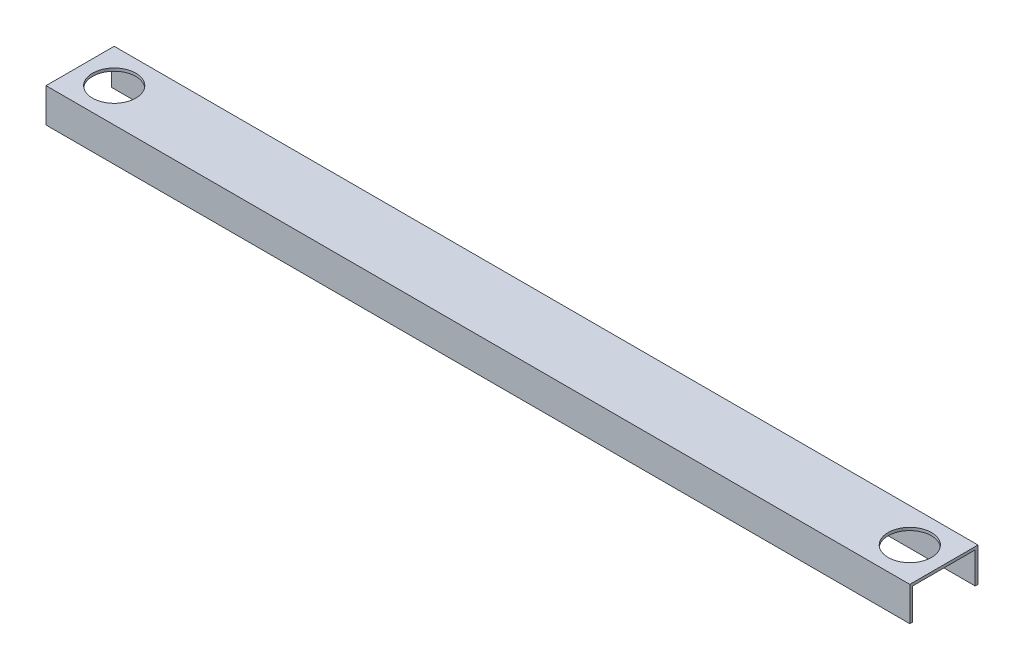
ISO-10303-21;
HEADER;
FILE_DESCRIPTION(('STEP AP214'),'2;1');
FILE_NAME('part.step','',(''),(''),'','','');
FILE_SCHEMA(('AUTOMOTIVE_DESIGN { 1 0 10303 214 1 1 1 1 }'));
ENDSEC;
DATA;
#1=APPLICATION_CONTEXT('core data for automotive mechanical design processes');
#2=APPLICATION_PROTOCOL_DEFINITION('international standard','automotive_design',2000,#1);
#3=PRODUCT_CONTEXT('',#1,'mechanical');
#4=PRODUCT('Part','Part','',(#3));
#5=PRODUCT_RELATED_PRODUCT_CATEGORY('part','',(#4));
#6=PRODUCT_DEFINITION_FORMATION('','',#4);
#7=PRODUCT_DEFINITION_CONTEXT('part definition',#1,'design');
#8=PRODUCT_DEFINITION('design','',#6,#7);
#9=PRODUCT_DEFINITION_SHAPE('','',#8);
#10=(LENGTH_UNIT() NAMED_UNIT(*) SI_UNIT(.MILLI.,.METRE.));
#11=(NAMED_UNIT(*) PLANE_ANGLE_UNIT() SI_UNIT($,.RADIAN.));
#12=(NAMED_UNIT(*) SI_UNIT($,.STERADIAN.) SOLID_ANGLE_UNIT());
#13=UNCERTAINTY_MEASURE_WITH_UNIT(LENGTH_MEASURE(1.E-05),#10,'distance_accuracy_value','');
#14=(GEOMETRIC_REPRESENTATION_CONTEXT(3) GLOBAL_UNCERTAINTY_ASSIGNED_CONTEXT((#13)) GLOBAL_UNIT_ASSIGNED_CONTEXT((#10,
#11,#12)) REPRESENTATION_CONTEXT('',''));
#15=CARTESIAN_POINT('',(0.,0.,0.));
#16=DIRECTION('',(0.,0.,1.));
#17=DIRECTION('',(1.,0.,0.));
#18=AXIS2_PLACEMENT_3D('',#15,#16,#17);
#19=CARTESIAN_POINT('',(482.6,19.05,38.1));
#20=DIRECTION('',(0.,-1.,0.));
#21=DIRECTION('',(0.,0.,-1.));
#22=AXIS2_PLACEMENT_3D('',#19,#20,#21);
#23=PLANE('',#22);
#24=DIRECTION('',(0.,0.,1.));
#25=VECTOR('',#24,1.);
#26=CARTESIAN_POINT('',(-482.6,19.05,38.1));
#27=LINE('',#26,#25);
#28=CARTESIAN_POINT('',(-482.6,19.05,-38.1));
#29=VERTEX_POINT('',#28);
#30=CARTESIAN_POINT('',(-482.6,19.05,38.1));
#31=VERTEX_POINT('',#30);
#32=EDGE_CURVE('E133',#29,#31,#27,.T.);
#33=ORIENTED_EDGE('',*,*,#32,.T.);
#34=DIRECTION('',(-1.,0.,0.));
#35=VECTOR('',#34,1.);
#36=CARTESIAN_POINT('',(482.6,19.05,38.1));
#37=LINE('',#36,#35);
#38=CARTESIAN_POINT('',(482.6,19.05,38.1));
#39=VERTEX_POINT('',#38);
#40=EDGE_CURVE('E40',#39,#31,#37,.T.);
#41=ORIENTED_EDGE('',*,*,#40,.F.);
#42=DIRECTION('',(0.,0.,1.));
#43=VECTOR('',#42,1.);
#44=CARTESIAN_POINT('',(482.6,19.05,38.1));
#45=LINE('',#44,#43);
#46=CARTESIAN_POINT('',(482.6,19.05,-38.1));
#47=VERTEX_POINT('',#46);
#48=EDGE_CURVE('E91',#47,#39,#45,.T.);
#49=ORIENTED_EDGE('',*,*,#48,.F.);
#50=DIRECTION('',(-1.,0.,0.));
#51=VECTOR('',#50,1.);
#52=CARTESIAN_POINT('',(482.6,19.05,-38.1));
#53=LINE('',#52,#51);
#54=EDGE_CURVE('E11',#47,#29,#53,.T.);
#55=ORIENTED_EDGE('',*,*,#54,.T.);
#56=EDGE_LOOP('',(#33,#41,#49,#55));
#57=FACE_BOUND('',#56,.T.);
#58=CARTESIAN_POINT('',(-444.5,19.05,0.));
#59=DIRECTION('',(0.,1.,0.));
#60=DIRECTION('',(0.,0.,1.));
#61=AXIS2_PLACEMENT_3D('',#58,#59,#60);
#62=CIRCLE('',#61,24.1935);
#63=CARTESIAN_POINT('',(-444.5,19.05,24.1935));
#64=VERTEX_POINT('',#63);
#65=EDGE_CURVE('E158',#64,#64,#62,.T.);
#66=ORIENTED_EDGE('',*,*,#65,.F.);
#67=EDGE_LOOP('',(#66));
#68=FACE_BOUND('',#67,.T.);
#69=CARTESIAN_POINT('',(444.5,19.05,0.));
#70=DIRECTION('',(0.,-1.,0.));
#71=DIRECTION('',(0.,0.,1.));
#72=AXIS2_PLACEMENT_3D('',#69,#70,#71);
#73=CIRCLE('',#72,24.1935);
#74=CARTESIAN_POINT('',(444.5,19.05,24.1935));
#75=VERTEX_POINT('',#74);
#76=EDGE_CURVE('E165',#75,#75,#73,.T.);
#77=ORIENTED_EDGE('',*,*,#76,.T.);
#78=EDGE_LOOP('',(#77));
#79=FACE_BOUND('',#78,.T.);
#80=ADVANCED_FACE('F30',(#57,#68,#79),#23,.F.);
#81=CARTESIAN_POINT('',(482.6,15.875,34.925));
#82=DIRECTION('',(0.,1.,0.));
#83=DIRECTION('',(0.,0.,1.));
#84=AXIS2_PLACEMENT_3D('',#81,#82,#83);
#85=PLANE('',#84);
#86=DIRECTION('',(0.,0.,-1.));
#87=VECTOR('',#86,1.);
#88=CARTESIAN_POINT('',(-482.6,15.875,34.925));
#89=LINE('',#88,#87);
#90=CARTESIAN_POINT('',(-482.6,15.875,34.925));
#91=VERTEX_POINT('',#90);
#92=CARTESIAN_POINT('',(-482.6,15.875,-34.925));
#93=VERTEX_POINT('',#92);
#94=EDGE_CURVE('E120',#91,#93,#89,.T.);
#95=ORIENTED_EDGE('',*,*,#94,.T.);
#96=DIRECTION('',(-1.,0.,0.));
#97=VECTOR('',#96,1.);
#98=CARTESIAN_POINT('',(482.6,15.875,-34.925));
#99=LINE('',#98,#97);
#100=CARTESIAN_POINT('',(482.6,15.875,-34.925));
#101=VERTEX_POINT('',#100);
#102=EDGE_CURVE('E116',#101,#93,#99,.T.);
#103=ORIENTED_EDGE('',*,*,#102,.F.);
#104=DIRECTION('',(0.,0.,-1.));
#105=VECTOR('',#104,1.);
#106=CARTESIAN_POINT('',(482.6,15.875,34.925));
#107=LINE('',#106,#105);
#108=CARTESIAN_POINT('',(482.6,15.875,34.925));
#109=VERTEX_POINT('',#108);
#110=EDGE_CURVE('E104',#109,#101,#107,.T.);
#111=ORIENTED_EDGE('',*,*,#110,.F.);
#112=DIRECTION('',(-1.,0.,0.));
#113=VECTOR('',#112,1.);
#114=CARTESIAN_POINT('',(482.6,15.875,34.925));
#115=LINE('',#114,#113);
#116=EDGE_CURVE('E121',#109,#91,#115,.T.);
#117=ORIENTED_EDGE('',*,*,#116,.T.);
#118=EDGE_LOOP('',(#95,#103,#111,#117));
#119=FACE_BOUND('',#118,.T.);
#120=CARTESIAN_POINT('',(-444.5,15.875,0.));
#121=DIRECTION('',(0.,1.,0.));
#122=DIRECTION('',(0.,0.,1.));
#123=AXIS2_PLACEMENT_3D('',#120,#121,#122);
#124=CIRCLE('',#123,24.1935);
#125=CARTESIAN_POINT('',(-444.5,15.875,24.1935));
#126=VERTEX_POINT('',#125);
#127=EDGE_CURVE('E134',#126,#126,#124,.T.);
#128=ORIENTED_EDGE('',*,*,#127,.T.);
#129=EDGE_LOOP('',(#128));
#130=FACE_BOUND('',#129,.T.);
#131=CARTESIAN_POINT('',(444.5,15.875,0.));
#132=DIRECTION('',(0.,1.,0.));
#133=DIRECTION('',(0.,0.,1.));
#134=AXIS2_PLACEMENT_3D('',#131,#132,#133);
#135=CIRCLE('',#134,24.1935);
#136=CARTESIAN_POINT('',(444.5,15.875,24.1935));
#137=VERTEX_POINT('',#136);
#138=EDGE_CURVE('E34',#137,#137,#135,.F.);
#139=ORIENTED_EDGE('',*,*,#138,.F.);
#140=EDGE_LOOP('',(#139));
#141=FACE_BOUND('',#140,.T.);
#142=ADVANCED_FACE('F117',(#119,#130,#141),#85,.F.);
#143=CARTESIAN_POINT('',(482.6,-19.05,-38.1));
#144=DIRECTION('',(0.,0.,1.));
#145=DIRECTION('',(1.,0.,0.));
#146=AXIS2_PLACEMENT_3D('',#143,#144,#145);
#147=PLANE('',#146);
#148=DIRECTION('',(0.,1.,0.));
#149=VECTOR('',#148,1.);
#150=CARTESIAN_POINT('',(-482.6,-19.05,-38.1));
#151=LINE('',#150,#149);
#152=CARTESIAN_POINT('',(-482.6,-19.05,-38.1));
#153=VERTEX_POINT('',#152);
#154=EDGE_CURVE('E130',#153,#29,#151,.T.);
#155=ORIENTED_EDGE('',*,*,#154,.T.);
#156=ORIENTED_EDGE('',*,*,#54,.F.);
#157=DIRECTION('',(0.,1.,0.));
#158=VECTOR('',#157,1.);
#159=CARTESIAN_POINT('',(482.6,-19.05,-38.1));
#160=LINE('',#159,#158);
#161=CARTESIAN_POINT('',(482.6,-19.05,-38.1));
#162=VERTEX_POINT('',#161);
#163=EDGE_CURVE('E146',#162,#47,#160,.T.);
#164=ORIENTED_EDGE('',*,*,#163,.F.);
#165=DIRECTION('',(-1.,0.,0.));
#166=VECTOR('',#165,1.);
#167=CARTESIAN_POINT('',(482.6,-19.05,-38.1));
#168=LINE('',#167,#166);
#169=EDGE_CURVE('E126',#162,#153,#168,.T.);
#170=ORIENTED_EDGE('',*,*,#169,.T.);
#171=EDGE_LOOP('',(#155,#156,#164,#170));
#172=FACE_BOUND('',#171,.T.);
#173=ADVANCED_FACE('F32',(#172),#147,.F.);
#174=CARTESIAN_POINT('',(482.6,-19.05,38.1));
#175=DIRECTION('',(0.,0.,-1.));
#176=DIRECTION('',(-1.,0.,0.));
#177=AXIS2_PLACEMENT_3D('',#174,#175,#176);
#178=PLANE('',#177);
#179=DIRECTION('',(0.,-1.,0.));
#180=VECTOR('',#179,1.);
#181=CARTESIAN_POINT('',(-482.6,-19.05,38.1));
#182=LINE('',#181,#180);
#183=CARTESIAN_POINT('',(-482.6,-19.05,38.1));
#184=VERTEX_POINT('',#183);
#185=EDGE_CURVE('E136',#31,#184,#182,.T.);
#186=ORIENTED_EDGE('',*,*,#185,.T.);
#187=DIRECTION('',(-1.,0.,0.));
#188=VECTOR('',#187,1.);
#189=CARTESIAN_POINT('',(482.6,-19.05,38.1));
#190=LINE('',#189,#188);
#191=CARTESIAN_POINT('',(482.6,-19.05,38.1));
#192=VERTEX_POINT('',#191);
#193=EDGE_CURVE('E153',#192,#184,#190,.T.);
#194=ORIENTED_EDGE('',*,*,#193,.F.);
#195=DIRECTION('',(0.,-1.,0.));
#196=VECTOR('',#195,1.);
#197=CARTESIAN_POINT('',(482.6,-19.05,38.1));
#198=LINE('',#197,#196);
#199=EDGE_CURVE('E170',#39,#192,#198,.T.);
#200=ORIENTED_EDGE('',*,*,#199,.F.);
#201=ORIENTED_EDGE('',*,*,#40,.T.);
#202=EDGE_LOOP('',(#186,#194,#200,#201));
#203=FACE_BOUND('',#202,.T.);
#204=ADVANCED_FACE('F206',(#203),#178,.F.);
#205=CARTESIAN_POINT('',(482.6,-19.05,38.1));
#206=DIRECTION('',(0.,1.,0.));
#207=DIRECTION('',(0.,0.,1.));
#208=AXIS2_PLACEMENT_3D('',#205,#206,#207);
#209=PLANE('',#208);
#210=DIRECTION('',(0.,0.,-1.));
#211=VECTOR('',#210,1.);
#212=CARTESIAN_POINT('',(-482.6,-19.05,38.1));
#213=LINE('',#212,#211);
#214=CARTESIAN_POINT('',(-482.6,-19.05,34.925));
#215=VERTEX_POINT('',#214);
#216=EDGE_CURVE('E138',#184,#215,#213,.T.);
#217=ORIENTED_EDGE('',*,*,#216,.T.);
#218=DIRECTION('',(-1.,0.,0.));
#219=VECTOR('',#218,1.);
#220=CARTESIAN_POINT('',(482.6,-19.05,34.925));
#221=LINE('',#220,#219);
#222=CARTESIAN_POINT('',(482.6,-19.05,34.925));
#223=VERTEX_POINT('',#222);
#224=EDGE_CURVE('E150',#223,#215,#221,.T.);
#225=ORIENTED_EDGE('',*,*,#224,.F.);
#226=DIRECTION('',(0.,0.,-1.));
#227=VECTOR('',#226,1.);
#228=CARTESIAN_POINT('',(482.6,-19.05,38.1));
#229=LINE('',#228,#227);
#230=EDGE_CURVE('E172',#192,#223,#229,.T.);
#231=ORIENTED_EDGE('',*,*,#230,.F.);
#232=ORIENTED_EDGE('',*,*,#193,.T.);
#233=EDGE_LOOP('',(#217,#225,#231,#232));
#234=FACE_BOUND('',#233,.T.);
#235=ADVANCED_FACE('F178',(#234),#209,.F.);
#236=CARTESIAN_POINT('',(482.6,-15.875,34.925));
#237=DIRECTION('',(0.,0.,1.));
#238=DIRECTION('',(1.,0.,0.));
#239=AXIS2_PLACEMENT_3D('',#236,#237,#238);
#240=PLANE('',#239);
#241=DIRECTION('',(0.,1.,0.));
#242=VECTOR('',#241,1.);
#243=CARTESIAN_POINT('',(-482.6,-15.875,34.925));
#244=LINE('',#243,#242);
#245=EDGE_CURVE('E141',#215,#91,#244,.T.);
#246=ORIENTED_EDGE('',*,*,#245,.T.);
#247=ORIENTED_EDGE('',*,*,#116,.F.);
#248=DIRECTION('',(0.,1.,0.));
#249=VECTOR('',#248,1.);
#250=CARTESIAN_POINT('',(482.6,-15.875,34.925));
#251=LINE('',#250,#249);
#252=EDGE_CURVE('E110',#223,#109,#251,.T.);
#253=ORIENTED_EDGE('',*,*,#252,.F.);
#254=ORIENTED_EDGE('',*,*,#224,.T.);
#255=EDGE_LOOP('',(#246,#247,#253,#254));
#256=FACE_BOUND('',#255,.T.);
#257=ADVANCED_FACE('F181',(#256),#240,.F.);
#258=CARTESIAN_POINT('',(482.6,-15.875,-34.925));
#259=DIRECTION('',(0.,0.,-1.));
#260=DIRECTION('',(0.,1.,0.));
#261=AXIS2_PLACEMENT_3D('',#258,#259,#260);
#262=PLANE('',#261);
#263=DIRECTION('',(0.,-1.,0.));
#264=VECTOR('',#263,1.);
#265=CARTESIAN_POINT('',(-482.6,-15.875,-34.925));
#266=LINE('',#265,#264);
#267=CARTESIAN_POINT('',(-482.6,-19.05,-34.925));
#268=VERTEX_POINT('',#267);
#269=EDGE_CURVE('E77',#93,#268,#266,.T.);
#270=ORIENTED_EDGE('',*,*,#269,.T.);
#271=DIRECTION('',(-1.,0.,0.));
#272=VECTOR('',#271,1.);
#273=CARTESIAN_POINT('',(482.6,-19.05,-34.925));
#274=LINE('',#273,#272);
#275=CARTESIAN_POINT('',(482.6,-19.05,-34.925));
#276=VERTEX_POINT('',#275);
#277=EDGE_CURVE('E122',#276,#268,#274,.T.);
#278=ORIENTED_EDGE('',*,*,#277,.F.);
#279=DIRECTION('',(0.,-1.,0.));
#280=VECTOR('',#279,1.);
#281=CARTESIAN_POINT('',(482.6,-15.875,-34.925));
#282=LINE('',#281,#280);
#283=EDGE_CURVE('E108',#101,#276,#282,.T.);
#284=ORIENTED_EDGE('',*,*,#283,.F.);
#285=ORIENTED_EDGE('',*,*,#102,.T.);
#286=EDGE_LOOP('',(#270,#278,#284,#285));
#287=FACE_BOUND('',#286,.T.);
#288=ADVANCED_FACE('F124',(#287),#262,.F.);
#289=CARTESIAN_POINT('',(482.6,-19.05,-34.925));
#290=DIRECTION('',(0.,1.,0.));
#291=DIRECTION('',(0.,0.,1.));
#292=AXIS2_PLACEMENT_3D('',#289,#290,#291);
#293=PLANE('',#292);
#294=DIRECTION('',(0.,0.,-1.));
#295=VECTOR('',#294,1.);
#296=CARTESIAN_POINT('',(-482.6,-19.05,-34.925));
#297=LINE('',#296,#295);
#298=EDGE_CURVE('E83',#268,#153,#297,.T.);
#299=ORIENTED_EDGE('',*,*,#298,.T.);
#300=ORIENTED_EDGE('',*,*,#169,.F.);
#301=DIRECTION('',(0.,0.,-1.));
#302=VECTOR('',#301,1.);
#303=CARTESIAN_POINT('',(482.6,-19.05,-34.925));
#304=LINE('',#303,#302);
#305=EDGE_CURVE('E49',#276,#162,#304,.T.);
#306=ORIENTED_EDGE('',*,*,#305,.F.);
#307=ORIENTED_EDGE('',*,*,#277,.T.);
#308=EDGE_LOOP('',(#299,#300,#306,#307));
#309=FACE_BOUND('',#308,.T.);
#310=ADVANCED_FACE('F189',(#309),#293,.F.);
#311=CARTESIAN_POINT('',(482.6,19.05,-38.1));
#312=DIRECTION('',(-1.,0.,0.));
#313=DIRECTION('',(0.,0.,1.));
#314=AXIS2_PLACEMENT_3D('',#311,#312,#313);
#315=PLANE('',#314);
#316=ORIENTED_EDGE('',*,*,#163,.T.);
#317=ORIENTED_EDGE('',*,*,#48,.T.);
#318=ORIENTED_EDGE('',*,*,#199,.T.);
#319=ORIENTED_EDGE('',*,*,#230,.T.);
#320=ORIENTED_EDGE('',*,*,#252,.T.);
#321=ORIENTED_EDGE('',*,*,#110,.T.);
#322=ORIENTED_EDGE('',*,*,#283,.T.);
#323=ORIENTED_EDGE('',*,*,#305,.T.);
#324=EDGE_LOOP('',(#316,#317,#318,#319,#320,#321,#322,#323));
#325=FACE_BOUND('',#324,.T.);
#326=ADVANCED_FACE('F106',(#325),#315,.F.);
#327=CARTESIAN_POINT('',(-482.6,19.05,-38.1));
#328=DIRECTION('',(-1.,0.,0.));
#329=DIRECTION('',(0.,0.,1.));
#330=AXIS2_PLACEMENT_3D('',#327,#328,#329);
#331=PLANE('',#330);
#332=ORIENTED_EDGE('',*,*,#154,.F.);
#333=ORIENTED_EDGE('',*,*,#298,.F.);
#334=ORIENTED_EDGE('',*,*,#269,.F.);
#335=ORIENTED_EDGE('',*,*,#94,.F.);
#336=ORIENTED_EDGE('',*,*,#245,.F.);
#337=ORIENTED_EDGE('',*,*,#216,.F.);
#338=ORIENTED_EDGE('',*,*,#185,.F.);
#339=ORIENTED_EDGE('',*,*,#32,.F.);
#340=EDGE_LOOP('',(#332,#333,#334,#335,#336,#337,#338,#339));
#341=FACE_BOUND('',#340,.T.);
#342=ADVANCED_FACE('F184',(#341),#331,.T.);
#343=CARTESIAN_POINT('',(-444.5,-19.05,0.));
#344=DIRECTION('',(0.,1.,0.));
#345=DIRECTION('',(0.,0.,1.));
#346=AXIS2_PLACEMENT_3D('',#343,#344,#345);
#347=CYLINDRICAL_SURFACE('',#346,24.1935);
#348=CARTESIAN_POINT('',(-444.5,19.05,24.1935));
#349=CARTESIAN_POINT('',(-444.5,19.0169270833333,24.1935));
#350=CARTESIAN_POINT('',(-444.5,18.9838541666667,24.1935));
#351=CARTESIAN_POINT('',(-444.5,18.9177083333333,24.1935));
#352=CARTESIAN_POINT('',(-444.5,18.8846354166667,24.1935));
#353=CARTESIAN_POINT('',(-444.5,18.8184895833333,24.1935));
#354=CARTESIAN_POINT('',(-444.5,18.7854166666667,24.1935));
#355=CARTESIAN_POINT('',(-444.5,18.7192708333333,24.1935));
#356=CARTESIAN_POINT('',(-444.5,18.6861979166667,24.1935));
#357=CARTESIAN_POINT('',(-444.5,18.6200520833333,24.1935));
#358=CARTESIAN_POINT('',(-444.5,18.5869791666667,24.1935));
#359=CARTESIAN_POINT('',(-444.5,18.5208333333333,24.1935));
#360=CARTESIAN_POINT('',(-444.5,18.4877604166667,24.1935));
#361=CARTESIAN_POINT('',(-444.5,18.4216145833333,24.1935));
#362=CARTESIAN_POINT('',(-444.5,18.3885416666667,24.1935));
#363=CARTESIAN_POINT('',(-444.5,18.3223958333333,24.1935));
#364=CARTESIAN_POINT('',(-444.5,18.2893229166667,24.1935));
#365=CARTESIAN_POINT('',(-444.5,18.2231770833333,24.1935));
#366=CARTESIAN_POINT('',(-444.5,18.1901041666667,24.1935));
#367=CARTESIAN_POINT('',(-444.5,18.1239583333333,24.1935));
#368=CARTESIAN_POINT('',(-444.5,18.0908854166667,24.1935));
#369=CARTESIAN_POINT('',(-444.5,18.0247395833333,24.1935));
#370=CARTESIAN_POINT('',(-444.5,17.9916666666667,24.1935));
#371=CARTESIAN_POINT('',(-444.5,17.9255208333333,24.1935));
#372=CARTESIAN_POINT('',(-444.5,17.8924479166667,24.1935));
#373=CARTESIAN_POINT('',(-444.5,17.8263020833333,24.1935));
#374=CARTESIAN_POINT('',(-444.5,17.7932291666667,24.1935));
#375=CARTESIAN_POINT('',(-444.5,17.7270833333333,24.1935));
#376=CARTESIAN_POINT('',(-444.5,17.6940104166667,24.1935));
#377=CARTESIAN_POINT('',(-444.5,17.6278645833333,24.1935));
#378=CARTESIAN_POINT('',(-444.5,17.5947916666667,24.1935));
#379=CARTESIAN_POINT('',(-444.5,17.5286458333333,24.1935));
#380=CARTESIAN_POINT('',(-444.5,17.4955729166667,24.1935));
#381=CARTESIAN_POINT('',(-444.5,17.4294270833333,24.1935));
#382=CARTESIAN_POINT('',(-444.5,17.3963541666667,24.1935));
#383=CARTESIAN_POINT('',(-444.5,17.3302083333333,24.1935));
#384=CARTESIAN_POINT('',(-444.5,17.2971354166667,24.1935));
#385=CARTESIAN_POINT('',(-444.5,17.2309895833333,24.1935));
#386=CARTESIAN_POINT('',(-444.5,17.1979166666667,24.1935));
#387=CARTESIAN_POINT('',(-444.5,17.1317708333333,24.1935));
#388=CARTESIAN_POINT('',(-444.5,17.0986979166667,24.1935));
#389=CARTESIAN_POINT('',(-444.5,17.0325520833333,24.1935));
#390=CARTESIAN_POINT('',(-444.5,16.9994791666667,24.1935));
#391=CARTESIAN_POINT('',(-444.5,16.9333333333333,24.1935));
#392=CARTESIAN_POINT('',(-444.5,16.9002604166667,24.1935));
#393=CARTESIAN_POINT('',(-444.5,16.8341145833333,24.1935));
#394=CARTESIAN_POINT('',(-444.5,16.8010416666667,24.1935));
#395=CARTESIAN_POINT('',(-444.5,16.7348958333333,24.1935));
#396=CARTESIAN_POINT('',(-444.5,16.7018229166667,24.1935));
#397=CARTESIAN_POINT('',(-444.5,16.6356770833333,24.1935));
#398=CARTESIAN_POINT('',(-444.5,16.6026041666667,24.1935));
#399=CARTESIAN_POINT('',(-444.5,16.5364583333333,24.1935));
#400=CARTESIAN_POINT('',(-444.5,16.5033854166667,24.1935));
#401=CARTESIAN_POINT('',(-444.5,16.4372395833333,24.1935));
#402=CARTESIAN_POINT('',(-444.5,16.4041666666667,24.1935));
#403=CARTESIAN_POINT('',(-444.5,16.3380208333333,24.1935));
#404=CARTESIAN_POINT('',(-444.5,16.3049479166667,24.1935));
#405=CARTESIAN_POINT('',(-444.5,16.2388020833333,24.1935));
#406=CARTESIAN_POINT('',(-444.5,16.2057291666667,24.1935));
#407=CARTESIAN_POINT('',(-444.5,16.1395833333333,24.1935));
#408=CARTESIAN_POINT('',(-444.5,16.1065104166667,24.1935));
#409=CARTESIAN_POINT('',(-444.5,16.0403645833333,24.1935));
#410=CARTESIAN_POINT('',(-444.5,16.0072916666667,24.1935));
#411=CARTESIAN_POINT('',(-444.5,15.9411458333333,24.1935));
#412=CARTESIAN_POINT('',(-444.5,15.9080729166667,24.1935));
#413=CARTESIAN_POINT('',(-444.5,15.875,24.1935));
#414=B_SPLINE_CURVE_WITH_KNOTS('',3,(#348,#349,#350,#351,#352,#353,#354,#355,#356,#357,#358,
#359,#360,#361,#362,#363,#364,#365,#366,#367,#368,#369,#370,#371,#372,#373,#374,#375,#376,#377,
#378,#379,#380,#381,#382,#383,#384,#385,#386,#387,#388,#389,#390,#391,#392,#393,#394,#395,#396,
#397,#398,#399,#400,#401,#402,#403,#404,#405,#406,#407,#408,#409,#410,#411,#412,#413),
.UNSPECIFIED.,.F.,.F.,(4,2,2,2,2,2,2,2,2,2,2,2,2,2,2,2,2,2,2,2,2,2,2,2,2,2,2,2,2,2,2,2,4),(0.,
0.0992187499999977,0.198437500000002,0.29765625,0.396875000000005,0.496093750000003,0.5953125,
0.694531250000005,0.793750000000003,0.892968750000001,0.992187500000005,1.09140625,1.190625,
1.28984375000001,1.3890625,1.48828125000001,1.58750000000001,1.68671875,1.78593750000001,
1.88515625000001,1.98437500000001,2.08359375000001,2.18281250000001,2.28203125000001,
2.38125000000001,2.48046875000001,2.57968750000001,2.67890625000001,2.77812500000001,
2.87734375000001,2.97656250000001,3.07578125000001,3.17500000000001),.UNSPECIFIED.);
#415=EDGE_CURVE('BSEAM241',#64,#126,#414,.T.);
#416=ORIENTED_EDGE('',*,*,#65,.T.);
#417=ORIENTED_EDGE('',*,*,#127,.F.);
#418=ORIENTED_EDGE('',*,*,#415,.T.);
#419=ORIENTED_EDGE('',*,*,#415,.F.);
#420=EDGE_LOOP('',(#416,#418,#417,#419));
#421=FACE_BOUND('',#420,.T.);
#422=ADVANCED_FACE('F241',(#421),#347,.F.);
#423=CARTESIAN_POINT('',(444.5,-19.05,0.));
#424=DIRECTION('',(0.,1.,0.));
#425=DIRECTION('',(0.,0.,1.));
#426=AXIS2_PLACEMENT_3D('',#423,#424,#425);
#427=CYLINDRICAL_SURFACE('',#426,24.1935);
#428=CARTESIAN_POINT('',(444.5,19.05,24.1935));
#429=CARTESIAN_POINT('',(444.5,19.0169270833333,24.1935));
#430=CARTESIAN_POINT('',(444.5,18.9838541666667,24.1935));
#431=CARTESIAN_POINT('',(444.5,18.9177083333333,24.1935));
#432=CARTESIAN_POINT('',(444.5,18.8846354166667,24.1935));
#433=CARTESIAN_POINT('',(444.5,18.8184895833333,24.1935));
#434=CARTESIAN_POINT('',(444.5,18.7854166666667,24.1935));
#435=CARTESIAN_POINT('',(444.5,18.7192708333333,24.1935));
#436=CARTESIAN_POINT('',(444.5,18.6861979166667,24.1935));
#437=CARTESIAN_POINT('',(444.5,18.6200520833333,24.1935));
#438=CARTESIAN_POINT('',(444.5,18.5869791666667,24.1935));
#439=CARTESIAN_POINT('',(444.5,18.5208333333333,24.1935));
#440=CARTESIAN_POINT('',(444.5,18.4877604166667,24.1935));
#441=CARTESIAN_POINT('',(444.5,18.4216145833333,24.1935));
#442=CARTESIAN_POINT('',(444.5,18.3885416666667,24.1935));
#443=CARTESIAN_POINT('',(444.5,18.3223958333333,24.1935));
#444=CARTESIAN_POINT('',(444.5,18.2893229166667,24.1935));
#445=CARTESIAN_POINT('',(444.5,18.2231770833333,24.1935));
#446=CARTESIAN_POINT('',(444.5,18.1901041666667,24.1935));
#447=CARTESIAN_POINT('',(444.5,18.1239583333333,24.1935));
#448=CARTESIAN_POINT('',(444.5,18.0908854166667,24.1935));
#449=CARTESIAN_POINT('',(444.5,18.0247395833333,24.1935));
#450=CARTESIAN_POINT('',(444.5,17.9916666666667,24.1935));
#451=CARTESIAN_POINT('',(444.5,17.9255208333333,24.1935));
#452=CARTESIAN_POINT('',(444.5,17.8924479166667,24.1935));
#453=CARTESIAN_POINT('',(444.5,17.8263020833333,24.1935));
#454=CARTESIAN_POINT('',(444.5,17.7932291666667,24.1935));
#455=CARTESIAN_POINT('',(444.5,17.7270833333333,24.1935));
#456=CARTESIAN_POINT('',(444.5,17.6940104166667,24.1935));
#457=CARTESIAN_POINT('',(444.5,17.6278645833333,24.1935));
#458=CARTESIAN_POINT('',(444.5,17.5947916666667,24.1935));
#459=CARTESIAN_POINT('',(444.5,17.5286458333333,24.1935));
#460=CARTESIAN_POINT('',(444.5,17.4955729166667,24.1935));
#461=CARTESIAN_POINT('',(444.5,17.4294270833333,24.1935));
#462=CARTESIAN_POINT('',(444.5,17.3963541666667,24.1935));
#463=CARTESIAN_POINT('',(444.5,17.3302083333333,24.1935));
#464=CARTESIAN_POINT('',(444.5,17.2971354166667,24.1935));
#465=CARTESIAN_POINT('',(444.5,17.2309895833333,24.1935));
#466=CARTESIAN_POINT('',(444.5,17.1979166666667,24.1935));
#467=CARTESIAN_POINT('',(444.5,17.1317708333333,24.1935));
#468=CARTESIAN_POINT('',(444.5,17.0986979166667,24.1935));
#469=CARTESIAN_POINT('',(444.5,17.0325520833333,24.1935));
#470=CARTESIAN_POINT('',(444.5,16.9994791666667,24.1935));
#471=CARTESIAN_POINT('',(444.5,16.9333333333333,24.1935));
#472=CARTESIAN_POINT('',(444.5,16.9002604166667,24.1935));
#473=CARTESIAN_POINT('',(444.5,16.8341145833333,24.1935));
#474=CARTESIAN_POINT('',(444.5,16.8010416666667,24.1935));
#475=CARTESIAN_POINT('',(444.5,16.7348958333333,24.1935));
#476=CARTESIAN_POINT('',(444.5,16.7018229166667,24.1935));
#477=CARTESIAN_POINT('',(444.5,16.6356770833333,24.1935));
#478=CARTESIAN_POINT('',(444.5,16.6026041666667,24.1935));
#479=CARTESIAN_POINT('',(444.5,16.5364583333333,24.1935));
#480=CARTESIAN_POINT('',(444.5,16.5033854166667,24.1935));
#481=CARTESIAN_POINT('',(444.5,16.4372395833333,24.1935));
#482=CARTESIAN_POINT('',(444.5,16.4041666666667,24.1935));
#483=CARTESIAN_POINT('',(444.5,16.3380208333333,24.1935));
#484=CARTESIAN_POINT('',(444.5,16.3049479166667,24.1935));
#485=CARTESIAN_POINT('',(444.5,16.2388020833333,24.1935));
#486=CARTESIAN_POINT('',(444.5,16.2057291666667,24.1935));
#487=CARTESIAN_POINT('',(444.5,16.1395833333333,24.1935));
#488=CARTESIAN_POINT('',(444.5,16.1065104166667,24.1935));
#489=CARTESIAN_POINT('',(444.5,16.0403645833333,24.1935));
#490=CARTESIAN_POINT('',(444.5,16.0072916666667,24.1935));
#491=CARTESIAN_POINT('',(444.5,15.9411458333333,24.1935));
#492=CARTESIAN_POINT('',(444.5,15.9080729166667,24.1935));
#493=CARTESIAN_POINT('',(444.5,15.875,24.1935));
#494=B_SPLINE_CURVE_WITH_KNOTS('',3,(#428,#429,#430,#431,#432,#433,#434,#435,#436,#437,#438,
#439,#440,#441,#442,#443,#444,#445,#446,#447,#448,#449,#450,#451,#452,#453,#454,#455,#456,#457,
#458,#459,#460,#461,#462,#463,#464,#465,#466,#467,#468,#469,#470,#471,#472,#473,#474,#475,#476,
#477,#478,#479,#480,#481,#482,#483,#484,#485,#486,#487,#488,#489,#490,#491,#492,#493),
.UNSPECIFIED.,.F.,.F.,(4,2,2,2,2,2,2,2,2,2,2,2,2,2,2,2,2,2,2,2,2,2,2,2,2,2,2,2,2,2,2,2,4),(0.,
0.0992187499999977,0.198437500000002,0.29765625,0.396875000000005,0.496093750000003,0.5953125,
0.694531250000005,0.793750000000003,0.892968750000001,0.992187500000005,1.09140625,1.190625,
1.28984375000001,1.3890625,1.48828125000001,1.58750000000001,1.68671875,1.78593750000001,
1.88515625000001,1.98437500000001,2.08359375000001,2.18281250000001,2.28203125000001,
2.38125000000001,2.48046875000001,2.57968750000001,2.67890625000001,2.77812500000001,
2.87734375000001,2.97656250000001,3.07578125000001,3.17500000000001),.UNSPECIFIED.);
#495=EDGE_CURVE('BSEAM248',#75,#137,#494,.T.);
#496=ORIENTED_EDGE('',*,*,#76,.F.);
#497=ORIENTED_EDGE('',*,*,#138,.T.);
#498=ORIENTED_EDGE('',*,*,#495,.T.);
#499=ORIENTED_EDGE('',*,*,#495,.F.);
#500=EDGE_LOOP('',(#496,#498,#497,#499));
#501=FACE_BOUND('',#500,.T.);
#502=ADVANCED_FACE('F248',(#501),#427,.F.);
#503=CLOSED_SHELL('',(#80,#142,#173,#204,#235,#257,#288,#310,#326,#342,#422,#502));
#504=MANIFOLD_SOLID_BREP('B2',#503);
#505=ADVANCED_BREP_SHAPE_REPRESENTATION('',(#18,#504),#14);
#506=SHAPE_DEFINITION_REPRESENTATION(#9,#505);
ENDSEC;
END-ISO-10303-21;
